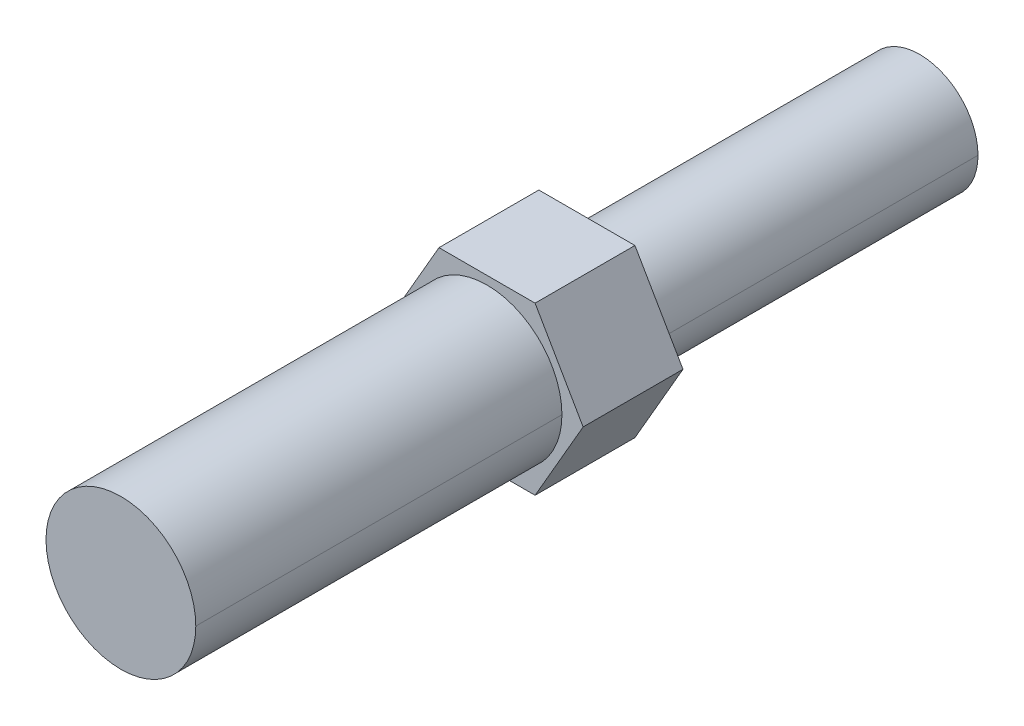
ISO-10303-21;
HEADER;
FILE_DESCRIPTION(('STEP AP214'),'2;1');
FILE_NAME('part.step','',(''),(''),'','','');
FILE_SCHEMA(('AUTOMOTIVE_DESIGN { 1 0 10303 214 1 1 1 1 }'));
ENDSEC;
DATA;
#1=APPLICATION_CONTEXT('core data for automotive mechanical design processes');
#2=APPLICATION_PROTOCOL_DEFINITION('international standard','automotive_design',2000,#1);
#3=PRODUCT_CONTEXT('',#1,'mechanical');
#4=PRODUCT('Part','Part','',(#3));
#5=PRODUCT_RELATED_PRODUCT_CATEGORY('part','',(#4));
#6=PRODUCT_DEFINITION_FORMATION('','',#4);
#7=PRODUCT_DEFINITION_CONTEXT('part definition',#1,'design');
#8=PRODUCT_DEFINITION('design','',#6,#7);
#9=PRODUCT_DEFINITION_SHAPE('','',#8);
#10=(LENGTH_UNIT() NAMED_UNIT(*) SI_UNIT(.MILLI.,.METRE.));
#11=(NAMED_UNIT(*) PLANE_ANGLE_UNIT() SI_UNIT($,.RADIAN.));
#12=(NAMED_UNIT(*) SI_UNIT($,.STERADIAN.) SOLID_ANGLE_UNIT());
#13=UNCERTAINTY_MEASURE_WITH_UNIT(LENGTH_MEASURE(1.E-05),#10,'distance_accuracy_value','');
#14=(GEOMETRIC_REPRESENTATION_CONTEXT(3) GLOBAL_UNCERTAINTY_ASSIGNED_CONTEXT((#13)) GLOBAL_UNIT_ASSIGNED_CONTEXT((#10,
#11,#12)) REPRESENTATION_CONTEXT('',''));
#15=CARTESIAN_POINT('',(0.,0.,0.));
#16=DIRECTION('',(0.,0.,1.));
#17=DIRECTION('',(1.,0.,0.));
#18=AXIS2_PLACEMENT_3D('',#15,#16,#17);
#19=CARTESIAN_POINT('',(-12.7152990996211,38.1,-76.2));
#20=DIRECTION('',(0.,0.,1.));
#21=DIRECTION('',(1.,0.,0.));
#22=AXIS2_PLACEMENT_3D('',#19,#20,#21);
#23=PLANE('',#22);
#24=CARTESIAN_POINT('',(0.,0.,-76.2));
#25=DIRECTION('',(0.,0.,1.));
#26=DIRECTION('',(1.,0.,0.));
#27=AXIS2_PLACEMENT_3D('',#24,#25,#26);
#28=CIRCLE('',#27,11.1125);
#29=CARTESIAN_POINT('',(11.1125,0.,-76.2));
#30=VERTEX_POINT('',#29);
#31=CARTESIAN_POINT('',(-11.1125,0.,-76.2));
#32=VERTEX_POINT('',#31);
#33=EDGE_CURVE('E65',#30,#32,#28,.T.);
#34=ORIENTED_EDGE('',*,*,#33,.F.);
#35=CARTESIAN_POINT('',(0.,0.,-76.2));
#36=DIRECTION('',(0.,0.,1.));
#37=DIRECTION('',(1.,0.,0.));
#38=AXIS2_PLACEMENT_3D('',#35,#36,#37);
#39=CIRCLE('',#38,11.1125);
#40=EDGE_CURVE('E19',#32,#30,#39,.T.);
#41=ORIENTED_EDGE('',*,*,#40,.F.);
#42=EDGE_LOOP('',(#34,#41));
#43=FACE_BOUND('',#42,.T.);
#44=ADVANCED_FACE('F16',(#43),#23,.F.);
#45=CARTESIAN_POINT('',(0.,0.,-88.9));
#46=DIRECTION('',(0.,0.,1.));
#47=DIRECTION('',(1.,0.,0.));
#48=AXIS2_PLACEMENT_3D('',#45,#46,#47);
#49=CYLINDRICAL_SURFACE('',#48,11.1125);
#50=DIRECTION('',(0.,0.,1.));
#51=VECTOR('',#50,1.);
#52=CARTESIAN_POINT('',(-11.1125,0.,-88.9));
#53=LINE('',#52,#51);
#54=CARTESIAN_POINT('',(-11.1125,0.,-12.7));
#55=VERTEX_POINT('',#54);
#56=EDGE_CURVE('E63',#32,#55,#53,.T.);
#57=ORIENTED_EDGE('',*,*,#56,.F.);
#58=ORIENTED_EDGE('',*,*,#40,.T.);
#59=DIRECTION('',(0.,0.,1.));
#60=VECTOR('',#59,1.);
#61=CARTESIAN_POINT('',(11.1125,0.,-88.9));
#62=LINE('',#61,#60);
#63=CARTESIAN_POINT('',(11.1125,0.,-12.7));
#64=VERTEX_POINT('',#63);
#65=EDGE_CURVE('E60',#64,#30,#62,.F.);
#66=ORIENTED_EDGE('',*,*,#65,.F.);
#67=CARTESIAN_POINT('',(0.,0.,-12.7));
#68=DIRECTION('',(0.,0.,1.));
#69=DIRECTION('',(1.,0.,0.));
#70=AXIS2_PLACEMENT_3D('',#67,#68,#69);
#71=CIRCLE('',#70,11.1125);
#72=EDGE_CURVE('E85',#55,#64,#71,.T.);
#73=ORIENTED_EDGE('',*,*,#72,.F.);
#74=EDGE_LOOP('',(#57,#58,#66,#73));
#75=FACE_BOUND('',#74,.T.);
#76=ADVANCED_FACE('F58',(#75),#49,.T.);
#77=CARTESIAN_POINT('',(0.,0.,-88.9));
#78=DIRECTION('',(0.,0.,1.));
#79=DIRECTION('',(1.,0.,0.));
#80=AXIS2_PLACEMENT_3D('',#77,#78,#79);
#81=CYLINDRICAL_SURFACE('',#80,11.1125);
#82=ORIENTED_EDGE('',*,*,#56,.T.);
#83=CARTESIAN_POINT('',(0.,0.,-12.7));
#84=DIRECTION('',(0.,0.,1.));
#85=DIRECTION('',(1.,0.,0.));
#86=AXIS2_PLACEMENT_3D('',#83,#84,#85);
#87=CIRCLE('',#86,11.1125);
#88=EDGE_CURVE('E69',#64,#55,#87,.T.);
#89=ORIENTED_EDGE('',*,*,#88,.F.);
#90=ORIENTED_EDGE('',*,*,#65,.T.);
#91=ORIENTED_EDGE('',*,*,#33,.T.);
#92=EDGE_LOOP('',(#82,#89,#90,#91));
#93=FACE_BOUND('',#92,.T.);
#94=ADVANCED_FACE('F67',(#93),#81,.T.);
#95=CARTESIAN_POINT('',(0.,0.,-12.7));
#96=DIRECTION('',(0.,0.,-1.));
#97=DIRECTION('',(-1.,0.,0.));
#98=AXIS2_PLACEMENT_3D('',#95,#96,#97);
#99=PLANE('',#98);
#100=ORIENTED_EDGE('',*,*,#72,.T.);
#101=ORIENTED_EDGE('',*,*,#88,.T.);
#102=EDGE_LOOP('',(#100,#101));
#103=FACE_BOUND('',#102,.T.);
#104=DIRECTION('',(1.,0.,0.));
#105=VECTOR('',#104,1.);
#106=CARTESIAN_POINT('',(9.16543552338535,-15.875,-12.7));
#107=LINE('',#106,#105);
#108=CARTESIAN_POINT('',(-9.16543552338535,-15.875,-12.7));
#109=VERTEX_POINT('',#108);
#110=CARTESIAN_POINT('',(9.16543552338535,-15.875,-12.7));
#111=VERTEX_POINT('',#110);
#112=EDGE_CURVE('E97',#109,#111,#107,.T.);
#113=ORIENTED_EDGE('',*,*,#112,.F.);
#114=DIRECTION('',(0.500000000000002,-0.866025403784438,0.));
#115=VECTOR('',#114,1.);
#116=CARTESIAN_POINT('',(-9.16543552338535,-15.875,-12.7));
#117=LINE('',#116,#115);
#118=CARTESIAN_POINT('',(-18.3308710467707,0.,-12.7));
#119=VERTEX_POINT('',#118);
#120=EDGE_CURVE('E102',#119,#109,#117,.T.);
#121=ORIENTED_EDGE('',*,*,#120,.F.);
#122=DIRECTION('',(-0.500000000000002,-0.866025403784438,0.));
#123=VECTOR('',#122,1.);
#124=CARTESIAN_POINT('',(-18.3308710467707,0.,-12.7));
#125=LINE('',#124,#123);
#126=CARTESIAN_POINT('',(-9.16543552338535,15.875,-12.7));
#127=VERTEX_POINT('',#126);
#128=EDGE_CURVE('E125',#127,#119,#125,.T.);
#129=ORIENTED_EDGE('',*,*,#128,.F.);
#130=DIRECTION('',(1.,0.,0.));
#131=VECTOR('',#130,1.);
#132=CARTESIAN_POINT('',(-9.16543552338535,15.875,-12.7));
#133=LINE('',#132,#131);
#134=CARTESIAN_POINT('',(9.16543552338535,15.875,-12.7));
#135=VERTEX_POINT('',#134);
#136=EDGE_CURVE('E151',#135,#127,#133,.F.);
#137=ORIENTED_EDGE('',*,*,#136,.F.);
#138=DIRECTION('',(-0.500000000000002,0.866025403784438,0.));
#139=VECTOR('',#138,1.);
#140=CARTESIAN_POINT('',(9.16543552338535,15.875,-12.7));
#141=LINE('',#140,#139);
#142=CARTESIAN_POINT('',(18.3308710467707,0.,-12.7));
#143=VERTEX_POINT('',#142);
#144=EDGE_CURVE('E84',#143,#135,#141,.T.);
#145=ORIENTED_EDGE('',*,*,#144,.F.);
#146=DIRECTION('',(0.500000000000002,0.866025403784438,0.));
#147=VECTOR('',#146,1.);
#148=CARTESIAN_POINT('',(18.3308710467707,0.,-12.7));
#149=LINE('',#148,#147);
#150=EDGE_CURVE('E107',#111,#143,#149,.T.);
#151=ORIENTED_EDGE('',*,*,#150,.F.);
#152=EDGE_LOOP('',(#113,#121,#129,#137,#145,#151));
#153=FACE_BOUND('',#152,.T.);
#154=ADVANCED_FACE('F87',(#103,#153),#99,.T.);
#155=CARTESIAN_POINT('',(9.16543552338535,15.875,-12.7));
#156=DIRECTION('',(0.866025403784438,0.500000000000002,0.));
#157=DIRECTION('',(-0.500000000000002,0.866025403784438,0.));
#158=AXIS2_PLACEMENT_3D('',#155,#156,#157);
#159=PLANE('',#158);
#160=ORIENTED_EDGE('',*,*,#144,.T.);
#161=DIRECTION('',(0.,0.,1.));
#162=VECTOR('',#161,1.);
#163=CARTESIAN_POINT('',(9.16543552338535,15.875,-12.7));
#164=LINE('',#163,#162);
#165=CARTESIAN_POINT('',(9.16543552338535,15.875,6.35));
#166=VERTEX_POINT('',#165);
#167=EDGE_CURVE('E146',#166,#135,#164,.F.);
#168=ORIENTED_EDGE('',*,*,#167,.F.);
#169=DIRECTION('',(0.500000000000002,-0.866025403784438,0.));
#170=VECTOR('',#169,1.);
#171=CARTESIAN_POINT('',(9.16543552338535,15.875,6.35));
#172=LINE('',#171,#170);
#173=CARTESIAN_POINT('',(18.3308710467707,0.,6.35));
#174=VERTEX_POINT('',#173);
#175=EDGE_CURVE('E200',#166,#174,#172,.T.);
#176=ORIENTED_EDGE('',*,*,#175,.T.);
#177=DIRECTION('',(0.,0.,1.));
#178=VECTOR('',#177,1.);
#179=CARTESIAN_POINT('',(18.3308710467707,0.,-12.7));
#180=LINE('',#179,#178);
#181=EDGE_CURVE('E113',#143,#174,#180,.T.);
#182=ORIENTED_EDGE('',*,*,#181,.F.);
#183=EDGE_LOOP('',(#160,#168,#176,#182));
#184=FACE_BOUND('',#183,.T.);
#185=ADVANCED_FACE('F90',(#184),#159,.T.);
#186=CARTESIAN_POINT('',(18.3308710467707,0.,-12.7));
#187=DIRECTION('',(0.866025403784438,-0.500000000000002,0.));
#188=DIRECTION('',(0.500000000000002,0.866025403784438,0.));
#189=AXIS2_PLACEMENT_3D('',#186,#187,#188);
#190=PLANE('',#189);
#191=ORIENTED_EDGE('',*,*,#150,.T.);
#192=ORIENTED_EDGE('',*,*,#181,.T.);
#193=DIRECTION('',(-0.500000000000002,-0.866025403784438,0.));
#194=VECTOR('',#193,1.);
#195=CARTESIAN_POINT('',(18.3308710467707,0.,6.35));
#196=LINE('',#195,#194);
#197=CARTESIAN_POINT('',(9.16543552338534,-15.875,6.35));
#198=VERTEX_POINT('',#197);
#199=EDGE_CURVE('E198',#174,#198,#196,.T.);
#200=ORIENTED_EDGE('',*,*,#199,.T.);
#201=DIRECTION('',(0.,0.,-1.));
#202=VECTOR('',#201,1.);
#203=CARTESIAN_POINT('',(9.16543552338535,-15.875,-12.7));
#204=LINE('',#203,#202);
#205=EDGE_CURVE('E112',#111,#198,#204,.F.);
#206=ORIENTED_EDGE('',*,*,#205,.F.);
#207=EDGE_LOOP('',(#191,#192,#200,#206));
#208=FACE_BOUND('',#207,.T.);
#209=ADVANCED_FACE('F205',(#208),#190,.T.);
#210=CARTESIAN_POINT('',(9.16543552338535,-15.875,-12.7));
#211=DIRECTION('',(0.,-1.,0.));
#212=DIRECTION('',(0.,0.,-1.));
#213=AXIS2_PLACEMENT_3D('',#210,#211,#212);
#214=PLANE('',#213);
#215=ORIENTED_EDGE('',*,*,#112,.T.);
#216=ORIENTED_EDGE('',*,*,#205,.T.);
#217=DIRECTION('',(-1.,0.,0.));
#218=VECTOR('',#217,1.);
#219=CARTESIAN_POINT('',(-9.16543552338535,-15.875,6.35));
#220=LINE('',#219,#218);
#221=CARTESIAN_POINT('',(-9.16543552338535,-15.875,6.35));
#222=VERTEX_POINT('',#221);
#223=EDGE_CURVE('E121',#198,#222,#220,.T.);
#224=ORIENTED_EDGE('',*,*,#223,.T.);
#225=DIRECTION('',(0.,0.,1.));
#226=VECTOR('',#225,1.);
#227=CARTESIAN_POINT('',(-9.16543552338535,-15.875,-12.7));
#228=LINE('',#227,#226);
#229=EDGE_CURVE('E117',#109,#222,#228,.T.);
#230=ORIENTED_EDGE('',*,*,#229,.F.);
#231=EDGE_LOOP('',(#215,#216,#224,#230));
#232=FACE_BOUND('',#231,.T.);
#233=ADVANCED_FACE('F118',(#232),#214,.T.);
#234=CARTESIAN_POINT('',(-9.16543552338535,-15.875,-12.7));
#235=DIRECTION('',(-0.866025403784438,-0.500000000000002,0.));
#236=DIRECTION('',(0.500000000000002,-0.866025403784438,0.));
#237=AXIS2_PLACEMENT_3D('',#234,#235,#236);
#238=PLANE('',#237);
#239=ORIENTED_EDGE('',*,*,#120,.T.);
#240=ORIENTED_EDGE('',*,*,#229,.T.);
#241=DIRECTION('',(-0.500000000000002,0.866025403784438,0.));
#242=VECTOR('',#241,1.);
#243=CARTESIAN_POINT('',(-9.16543552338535,-15.875,6.35));
#244=LINE('',#243,#242);
#245=CARTESIAN_POINT('',(-18.3308710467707,0.,6.35));
#246=VERTEX_POINT('',#245);
#247=EDGE_CURVE('E195',#222,#246,#244,.T.);
#248=ORIENTED_EDGE('',*,*,#247,.T.);
#249=DIRECTION('',(0.,0.,1.));
#250=VECTOR('',#249,1.);
#251=CARTESIAN_POINT('',(-18.3308710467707,0.,-12.7));
#252=LINE('',#251,#250);
#253=EDGE_CURVE('E129',#119,#246,#252,.T.);
#254=ORIENTED_EDGE('',*,*,#253,.F.);
#255=EDGE_LOOP('',(#239,#240,#248,#254));
#256=FACE_BOUND('',#255,.T.);
#257=ADVANCED_FACE('F127',(#256),#238,.T.);
#258=CARTESIAN_POINT('',(-18.3308710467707,0.,-12.7));
#259=DIRECTION('',(-0.866025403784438,0.500000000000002,0.));
#260=DIRECTION('',(-0.500000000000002,-0.866025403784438,0.));
#261=AXIS2_PLACEMENT_3D('',#258,#259,#260);
#262=PLANE('',#261);
#263=ORIENTED_EDGE('',*,*,#128,.T.);
#264=ORIENTED_EDGE('',*,*,#253,.T.);
#265=DIRECTION('',(0.500000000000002,0.866025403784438,0.));
#266=VECTOR('',#265,1.);
#267=CARTESIAN_POINT('',(-18.3308710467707,0.,6.35));
#268=LINE('',#267,#266);
#269=CARTESIAN_POINT('',(-9.16543552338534,15.875,6.35));
#270=VERTEX_POINT('',#269);
#271=EDGE_CURVE('E181',#246,#270,#268,.T.);
#272=ORIENTED_EDGE('',*,*,#271,.T.);
#273=DIRECTION('',(0.,0.,1.));
#274=VECTOR('',#273,1.);
#275=CARTESIAN_POINT('',(-9.16543552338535,15.875,-12.7));
#276=LINE('',#275,#274);
#277=EDGE_CURVE('E155',#127,#270,#276,.T.);
#278=ORIENTED_EDGE('',*,*,#277,.F.);
#279=EDGE_LOOP('',(#263,#264,#272,#278));
#280=FACE_BOUND('',#279,.T.);
#281=ADVANCED_FACE('F164',(#280),#262,.T.);
#282=CARTESIAN_POINT('',(-9.16543552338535,15.875,-12.7));
#283=DIRECTION('',(0.,1.,0.));
#284=DIRECTION('',(0.,0.,1.));
#285=AXIS2_PLACEMENT_3D('',#282,#283,#284);
#286=PLANE('',#285);
#287=ORIENTED_EDGE('',*,*,#136,.T.);
#288=ORIENTED_EDGE('',*,*,#277,.T.);
#289=DIRECTION('',(-1.,0.,0.));
#290=VECTOR('',#289,1.);
#291=CARTESIAN_POINT('',(-9.16543552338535,15.875,6.35));
#292=LINE('',#291,#290);
#293=EDGE_CURVE('E82',#270,#166,#292,.F.);
#294=ORIENTED_EDGE('',*,*,#293,.T.);
#295=ORIENTED_EDGE('',*,*,#167,.T.);
#296=EDGE_LOOP('',(#287,#288,#294,#295));
#297=FACE_BOUND('',#296,.T.);
#298=ADVANCED_FACE('F157',(#297),#286,.T.);
#299=CARTESIAN_POINT('',(-9.16543552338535,15.875,6.35));
#300=DIRECTION('',(0.,0.,-1.));
#301=DIRECTION('',(-1.,0.,0.));
#302=AXIS2_PLACEMENT_3D('',#299,#300,#301);
#303=PLANE('',#302);
#304=CARTESIAN_POINT('',(0.,0.,6.34999999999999));
#305=DIRECTION('',(0.,0.,1.));
#306=DIRECTION('',(1.,0.,0.));
#307=AXIS2_PLACEMENT_3D('',#304,#305,#306);
#308=CIRCLE('',#307,14.2875);
#309=CARTESIAN_POINT('',(14.2875,0.,6.34999999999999));
#310=VERTEX_POINT('',#309);
#311=CARTESIAN_POINT('',(-14.2875,0.,6.34999999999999));
#312=VERTEX_POINT('',#311);
#313=EDGE_CURVE('E75',#310,#312,#308,.T.);
#314=ORIENTED_EDGE('',*,*,#313,.F.);
#315=CARTESIAN_POINT('',(0.,0.,6.34999999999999));
#316=DIRECTION('',(0.,0.,1.));
#317=DIRECTION('',(1.,0.,0.));
#318=AXIS2_PLACEMENT_3D('',#315,#316,#317);
#319=CIRCLE('',#318,14.2875);
#320=EDGE_CURVE('E80',#312,#310,#319,.T.);
#321=ORIENTED_EDGE('',*,*,#320,.F.);
#322=EDGE_LOOP('',(#314,#321));
#323=FACE_BOUND('',#322,.T.);
#324=ORIENTED_EDGE('',*,*,#271,.F.);
#325=ORIENTED_EDGE('',*,*,#247,.F.);
#326=ORIENTED_EDGE('',*,*,#223,.F.);
#327=ORIENTED_EDGE('',*,*,#199,.F.);
#328=ORIENTED_EDGE('',*,*,#175,.F.);
#329=ORIENTED_EDGE('',*,*,#293,.F.);
#330=EDGE_LOOP('',(#324,#325,#326,#327,#328,#329));
#331=FACE_BOUND('',#330,.T.);
#332=ADVANCED_FACE('F202',(#323,#331),#303,.F.);
#333=CARTESIAN_POINT('',(0.,0.,69.85));
#334=DIRECTION('',(0.,0.,1.));
#335=DIRECTION('',(1.,0.,0.));
#336=AXIS2_PLACEMENT_3D('',#333,#334,#335);
#337=CYLINDRICAL_SURFACE('',#336,14.2875);
#338=DIRECTION('',(0.,0.,1.));
#339=VECTOR('',#338,1.);
#340=CARTESIAN_POINT('',(-14.2875,0.,69.85));
#341=LINE('',#340,#339);
#342=CARTESIAN_POINT('',(-14.2875,0.,76.2));
#343=VERTEX_POINT('',#342);
#344=EDGE_CURVE('E25',#312,#343,#341,.T.);
#345=ORIENTED_EDGE('',*,*,#344,.F.);
#346=ORIENTED_EDGE('',*,*,#320,.T.);
#347=DIRECTION('',(0.,0.,1.));
#348=VECTOR('',#347,1.);
#349=CARTESIAN_POINT('',(14.2875,0.,69.85));
#350=LINE('',#349,#348);
#351=CARTESIAN_POINT('',(14.2875,0.,76.2));
#352=VERTEX_POINT('',#351);
#353=EDGE_CURVE('E78',#352,#310,#350,.F.);
#354=ORIENTED_EDGE('',*,*,#353,.F.);
#355=CARTESIAN_POINT('',(0.,0.,76.2));
#356=DIRECTION('',(0.,0.,1.));
#357=DIRECTION('',(1.,0.,0.));
#358=AXIS2_PLACEMENT_3D('',#355,#356,#357);
#359=CIRCLE('',#358,14.2875);
#360=EDGE_CURVE('E34',#352,#343,#359,.F.);
#361=ORIENTED_EDGE('',*,*,#360,.T.);
#362=EDGE_LOOP('',(#345,#346,#354,#361));
#363=FACE_BOUND('',#362,.T.);
#364=ADVANCED_FACE('F183',(#363),#337,.T.);
#365=CARTESIAN_POINT('',(15.875,63.5,76.2));
#366=DIRECTION('',(0.,0.,-1.));
#367=DIRECTION('',(-1.,0.,0.));
#368=AXIS2_PLACEMENT_3D('',#365,#366,#367);
#369=PLANE('',#368);
#370=ORIENTED_EDGE('',*,*,#360,.F.);
#371=CARTESIAN_POINT('',(0.,0.,76.2));
#372=DIRECTION('',(0.,0.,1.));
#373=DIRECTION('',(1.,0.,0.));
#374=AXIS2_PLACEMENT_3D('',#371,#372,#373);
#375=CIRCLE('',#374,14.2875);
#376=EDGE_CURVE('E11',#343,#352,#375,.F.);
#377=ORIENTED_EDGE('',*,*,#376,.F.);
#378=EDGE_LOOP('',(#370,#377));
#379=FACE_BOUND('',#378,.T.);
#380=ADVANCED_FACE('F188',(#379),#369,.F.);
#381=CARTESIAN_POINT('',(0.,0.,69.85));
#382=DIRECTION('',(0.,0.,1.));
#383=DIRECTION('',(1.,0.,0.));
#384=AXIS2_PLACEMENT_3D('',#381,#382,#383);
#385=CYLINDRICAL_SURFACE('',#384,14.2875);
#386=ORIENTED_EDGE('',*,*,#344,.T.);
#387=ORIENTED_EDGE('',*,*,#376,.T.);
#388=ORIENTED_EDGE('',*,*,#353,.T.);
#389=ORIENTED_EDGE('',*,*,#313,.T.);
#390=EDGE_LOOP('',(#386,#387,#388,#389));
#391=FACE_BOUND('',#390,.T.);
#392=ADVANCED_FACE('F190',(#391),#385,.T.);
#393=CLOSED_SHELL('',(#44,#76,#94,#154,#185,#209,#233,#257,#281,#298,#332,#364,#380,#392));
#394=MANIFOLD_SOLID_BREP('B1',#393);
#395=ADVANCED_BREP_SHAPE_REPRESENTATION('',(#18,#394),#14);
#396=SHAPE_DEFINITION_REPRESENTATION(#9,#395);
ENDSEC;
END-ISO-10303-21;
